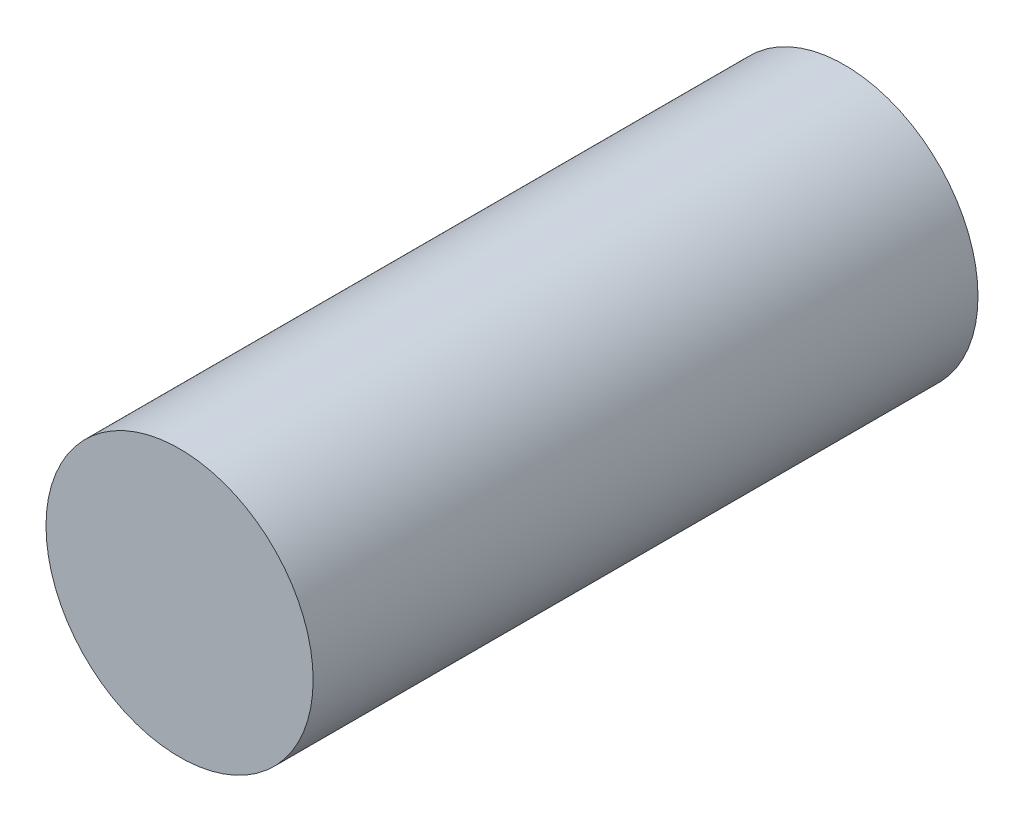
ISO-10303-21;
HEADER;
FILE_DESCRIPTION(('STEP AP214'),'2;1');
FILE_NAME('part.step','',(''),(''),'','','');
FILE_SCHEMA(('AUTOMOTIVE_DESIGN { 1 0 10303 214 1 1 1 1 }'));
ENDSEC;
DATA;
#1=APPLICATION_CONTEXT('core data for automotive mechanical design processes');
#2=APPLICATION_PROTOCOL_DEFINITION('international standard','automotive_design',2000,#1);
#3=PRODUCT_CONTEXT('',#1,'mechanical');
#4=PRODUCT('Part','Part','',(#3));
#5=PRODUCT_RELATED_PRODUCT_CATEGORY('part','',(#4));
#6=PRODUCT_DEFINITION_FORMATION('','',#4);
#7=PRODUCT_DEFINITION_CONTEXT('part definition',#1,'design');
#8=PRODUCT_DEFINITION('design','',#6,#7);
#9=PRODUCT_DEFINITION_SHAPE('','',#8);
#10=(LENGTH_UNIT() NAMED_UNIT(*) SI_UNIT(.MILLI.,.METRE.));
#11=(NAMED_UNIT(*) PLANE_ANGLE_UNIT() SI_UNIT($,.RADIAN.));
#12=(NAMED_UNIT(*) SI_UNIT($,.STERADIAN.) SOLID_ANGLE_UNIT());
#13=UNCERTAINTY_MEASURE_WITH_UNIT(LENGTH_MEASURE(1.E-05),#10,'distance_accuracy_value','');
#14=(GEOMETRIC_REPRESENTATION_CONTEXT(3) GLOBAL_UNCERTAINTY_ASSIGNED_CONTEXT((#13)) GLOBAL_UNIT_ASSIGNED_CONTEXT((#10,
#11,#12)) REPRESENTATION_CONTEXT('',''));
#15=CARTESIAN_POINT('',(0.,0.,0.));
#16=DIRECTION('',(0.,0.,1.));
#17=DIRECTION('',(1.,0.,0.));
#18=AXIS2_PLACEMENT_3D('',#15,#16,#17);
#19=CARTESIAN_POINT('',(0.,0.,280.));
#20=DIRECTION('',(0.,0.,-1.));
#21=DIRECTION('',(-1.,0.,0.));
#22=AXIS2_PLACEMENT_3D('',#19,#20,#21);
#23=CYLINDRICAL_SURFACE('',#22,112.5);
#24=CARTESIAN_POINT('',(0.,0.,280.));
#25=DIRECTION('',(0.,0.,1.));
#26=DIRECTION('',(1.,0.,0.));
#27=AXIS2_PLACEMENT_3D('',#24,#25,#26);
#28=CIRCLE('',#27,112.5);
#29=CARTESIAN_POINT('',(112.5,0.,280.));
#30=VERTEX_POINT('',#29);
#31=EDGE_CURVE('E10',#30,#30,#28,.T.);
#32=ORIENTED_EDGE('',*,*,#31,.F.);
#33=EDGE_LOOP('',(#32));
#34=FACE_BOUND('',#33,.T.);
#35=CARTESIAN_POINT('',(0.,0.,-280.));
#36=DIRECTION('',(0.,0.,1.));
#37=DIRECTION('',(1.,0.,0.));
#38=AXIS2_PLACEMENT_3D('',#35,#36,#37);
#39=CIRCLE('',#38,112.5);
#40=CARTESIAN_POINT('',(112.5,0.,-280.));
#41=VERTEX_POINT('',#40);
#42=EDGE_CURVE('E44',#41,#41,#39,.T.);
#43=ORIENTED_EDGE('',*,*,#42,.T.);
#44=EDGE_LOOP('',(#43));
#45=FACE_BOUND('',#44,.T.);
#46=ADVANCED_FACE('F41',(#34,#45),#23,.T.);
#47=CARTESIAN_POINT('',(0.,0.,280.));
#48=DIRECTION('',(0.,0.,1.));
#49=DIRECTION('',(1.,0.,0.));
#50=AXIS2_PLACEMENT_3D('',#47,#48,#49);
#51=PLANE('',#50);
#52=ORIENTED_EDGE('',*,*,#31,.T.);
#53=EDGE_LOOP('',(#52));
#54=FACE_BOUND('',#53,.T.);
#55=ADVANCED_FACE('F56',(#54),#51,.T.);
#56=CARTESIAN_POINT('',(0.,0.,-280.));
#57=DIRECTION('',(0.,0.,1.));
#58=DIRECTION('',(1.,0.,0.));
#59=AXIS2_PLACEMENT_3D('',#56,#57,#58);
#60=PLANE('',#59);
#61=ORIENTED_EDGE('',*,*,#42,.F.);
#62=EDGE_LOOP('',(#61));
#63=FACE_BOUND('',#62,.T.);
#64=ADVANCED_FACE('F54',(#63),#60,.F.);
#65=CLOSED_SHELL('',(#46,#55,#64));
#66=MANIFOLD_SOLID_BREP('B2',#65);
#67=ADVANCED_BREP_SHAPE_REPRESENTATION('',(#18,#66),#14);
#68=SHAPE_DEFINITION_REPRESENTATION(#9,#67);
ENDSEC;
END-ISO-10303-21;
